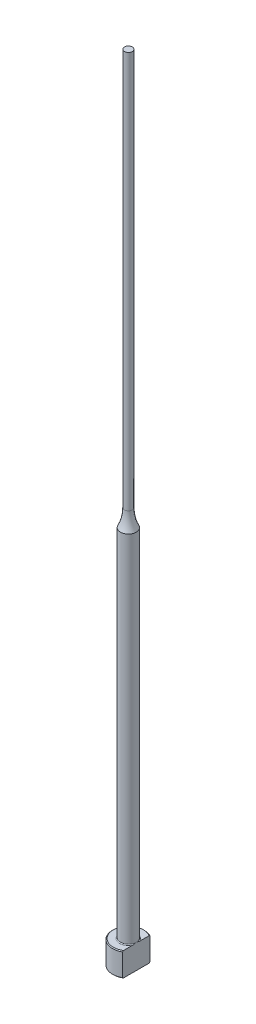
from build123d import *
from build123d.topology import SkipClean

# Parameters (mm, degrees)
CHAMFER1_SIZE    = 0.2
FILLET1_R        = 0.2
KEYED_HEAD_DEPTH = 201.079984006


with BuildPart() as part:
    # Sketch1 → Revolve1 (revolve)
    with BuildSketch(Plane.XY, mode=Mode.PRIVATE) as revolve1_sk:
        with BuildLine():
            Line((0, 0), (-4, 0))
            Line((-4, 0), (-4, 6))
            Line((-4, 6), (-2, 6))
            Line((-2, 6), (-2, 95.641101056))
            ThreePointArc((-2, 95.641101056), (-1.253205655, 97.763932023), (-1, 100))
            Line((-1, 100), (-1, 200))
            Line((-1, 200), (0, 200))
            Line((0, 200), (0, 0))
        make_face()
    revolve(revolve1_sk.sketch.rotate(Axis((0, 259.958771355, 0), (0, -1, 0)), 270), axis=Axis((0, 259.958771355, 0), (0, -1, 0)))

    # Chamfer1
    chamfer1_edges = [part.edges().sort_by_distance(p)[0] for p in [
        (0, 0, -4),
        (0, 6, -4),
    ]]
    chamfer(chamfer1_edges, length=CHAMFER1_SIZE)

    # Fillet1
    fillet1_edges = [part.edges().sort_by_distance(p)[0] for p in [
        (0, 6, -2),
    ]]
    fillet(fillet1_edges, radius=FILLET1_R)

    # Sketch2 → Keyed Head (cut, through all)
    with SkipClean():  # the faces are left unmerged after this step: merging them gives an invalid solid
        with BuildSketch(Plane(origin=(0, 0, 0), x_dir=(1, 0, 0), z_dir=(0, 1, 0))):
            with BuildLine():
                Line((2, -3.464101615), (2, 3.464101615))
                ThreePointArc((2, 3.464101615), (4, 0), (2, -3.464101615))
            make_face()
        extrude(amount=KEYED_HEAD_DEPTH, mode=Mode.SUBTRACT)


solid = part.part
